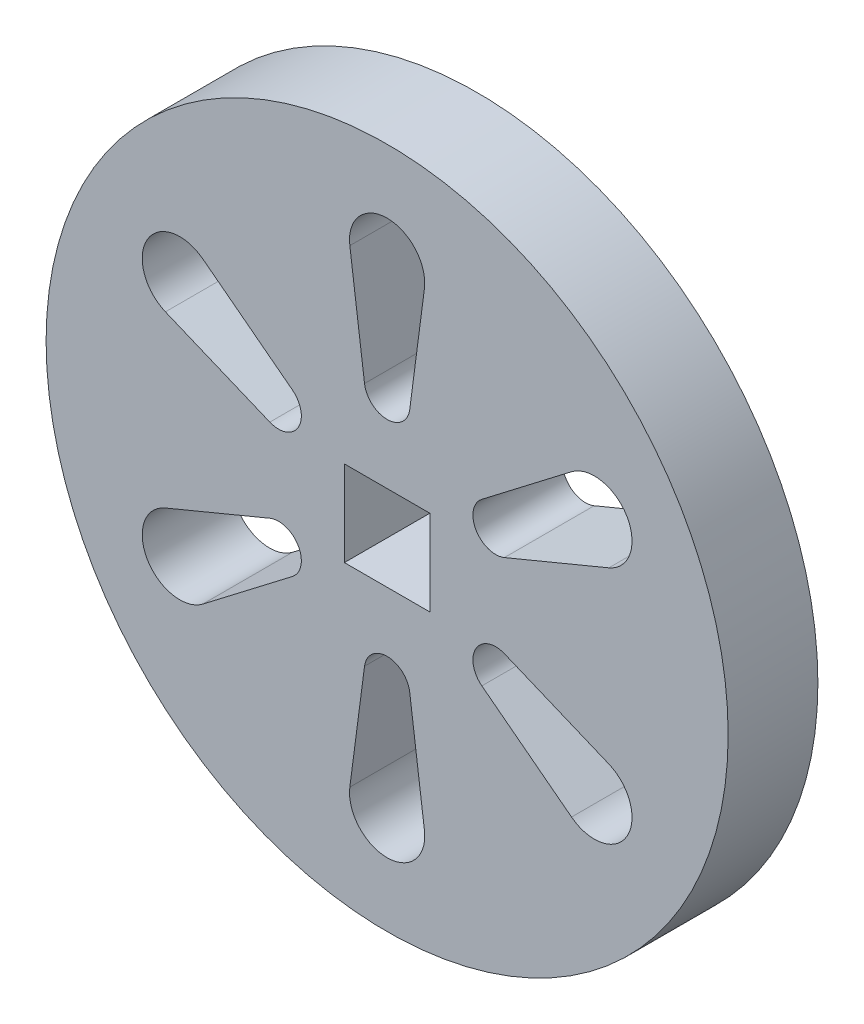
from build123d import *

# Parameters (mm, degrees)
SKETCH1_R           = 38
BOSS_EXTRUDE1_DEPTH = 10
SKETCH3_W           = 9.525
SKETCH3_H           = 9.525
CUT_EXTRUDE2_DEPTH  = 55.662601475
CUT_EXTRUDE3_DEPTH  = 55.662601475
CIRPATTERN2_COUNT   = 6


with BuildPart() as part:
    # Sketch1 → Boss-Extrude1 (new body)
    with BuildSketch(Plane.XY):
        Circle(SKETCH1_R)
    extrude(amount=BOSS_EXTRUDE1_DEPTH)

    # Sketch3 → Cut-Extrude2 (cut, through all)
    with BuildSketch(Plane.XY.offset(10)):
        Rectangle(SKETCH3_W, SKETCH3_H)
    extrude(amount=-CUT_EXTRUDE2_DEPTH, mode=Mode.SUBTRACT)

    # Sketch4 → Cut-Extrude3 (cut, through all)
    with BuildSketch(Plane.XY.offset(10)):
        with BuildLine():
            Line((-4.155435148, 26.12517), (-2.518445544, 13.6398))
            ThreePointArc((-2.518445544, 13.6398), (0, 11.43), (2.518445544, 13.6398))
            Line((2.518445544, 13.6398), (4.155435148, 26.12517))
            ThreePointArc((4.155435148, 26.12517), (0, 30.861), (-4.155435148, 26.12517))
        make_face()
    cut_extrude3 = extrude(amount=-CUT_EXTRUDE3_DEPTH, mode=Mode.SUBTRACT)

    # CirPattern2: Cut-Extrude3 ×6 about axis
    cirpattern2_axis = Axis((0, 0, 0), (0, 0, 1))
    for i in range(1, CIRPATTERN2_COUNT):
        add(cut_extrude3.rotate(cirpattern2_axis, i * 360 / CIRPATTERN2_COUNT), mode=Mode.SUBTRACT)


solid = part.part
